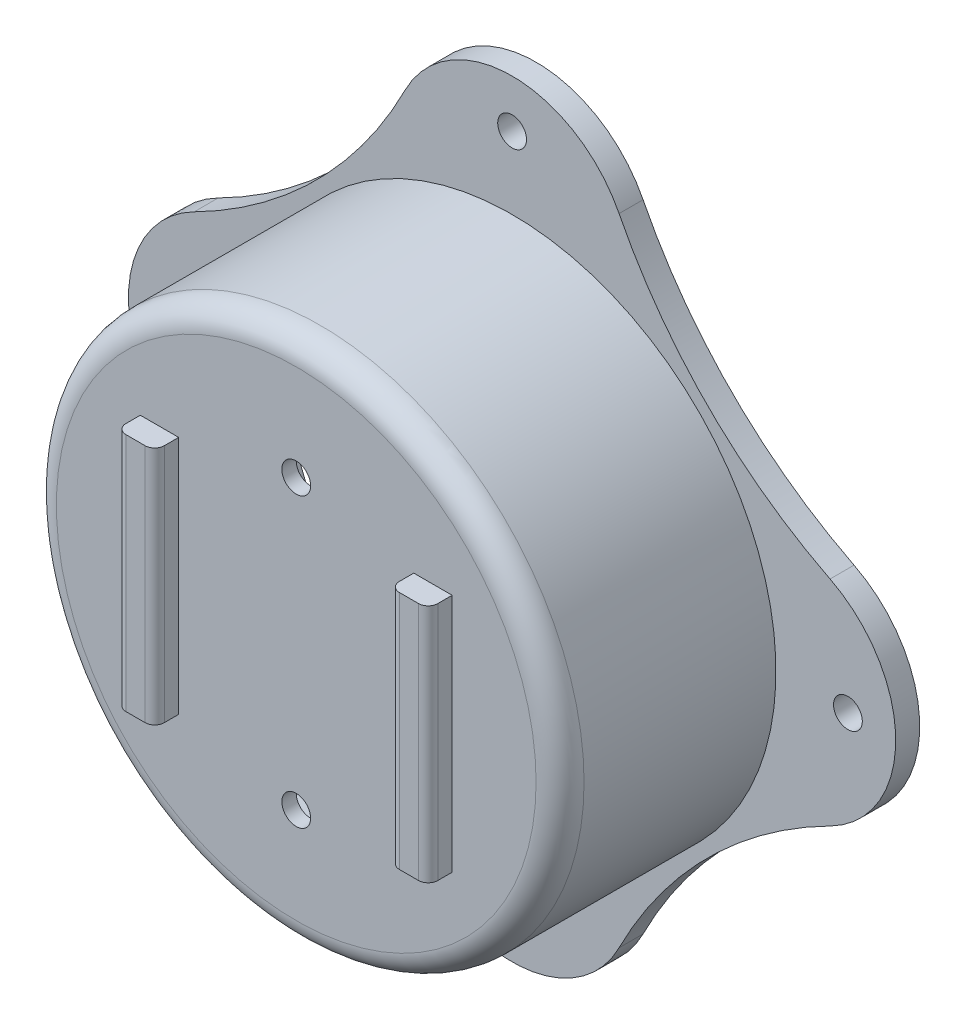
from build123d import *

# Parameters (mm, degrees)
IZIM1_R                     = 55
Y_KSEKLIK_EKSTR_ZYON1_DEPTH = 50
RADYUS1_R                   = 5
Y_KSEKLIK_EKSTR_ZYON2_DEPTH = 5
IZIM3_R                     = 52
KES_EKSTR_ZYON1_DEPTH       = 47
IZIM4_R                     = 3
KES_EKSTR_ZYON2_DEPTH       = 47
IZIM5_W                     = 8
IZIM5_H                     = 50
Y_KSEKLIK_EKSTR_ZYON3_DEPTH = 5
RADYUS2_R                   = 2
IZIM6_R                     = 3
KES_EKSTR_ZYON3_DEPTH       = 5


with BuildPart() as part:
    # izim1 → Y_kseklik-Ekstr_zyon1 (new body)
    with BuildSketch(Plane.XY):
        Circle(IZIM1_R)
    extrude(amount=Y_KSEKLIK_EKSTR_ZYON1_DEPTH)

    # Radyus1
    radyus1_edges = [part.edges().sort_by_distance(p)[0] for p in [
        (-55, 0, 50),
    ]]
    fillet(radyus1_edges, radius=RADYUS1_R)

    # izim2 → Y_kseklik-Ekstr_zyon2 (add)
    with BuildSketch(Plane(origin=(0, 0, 0), x_dir=(-1, 0, 0), z_dir=(0, 0, -1))):
        with BuildLine():
            ThreePointArc((22.297784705, 66.305255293), (-0.001214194, 79.999999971), (-22.298882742, 66.303089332))
            ThreePointArc((-22.298882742, 66.303089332), (-40.780281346, 40.808230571), (-66.273344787, 22.324355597))
            ThreePointArc((-66.273344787, 22.324355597), (-79.968089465, 0.025356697), (-66.271178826, -22.27231185))
            ThreePointArc((-66.271178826, -22.27231185), (-40.776320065, -40.753710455), (-22.292445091, -66.246773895))
            ThreePointArc((-22.292445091, -66.246773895), (0.006553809, -79.941518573), (22.304222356, -66.244607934))
            ThreePointArc((22.304222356, -66.244607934), (40.785620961, -40.749749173), (66.278684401, -22.265874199))
            ThreePointArc((66.278684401, -22.265874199), (79.973429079, 0.0331247), (66.27651844, 22.330793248))
            ThreePointArc((66.27651844, 22.330793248), (40.781659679, 40.812191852), (22.297784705, 66.305255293))
        make_face()
    extrude(amount=-Y_KSEKLIK_EKSTR_ZYON2_DEPTH)

    # izim3 → Kes-Ekstr_zyon1 (cut)
    with BuildSketch(Plane(origin=(0, 0, 0), x_dir=(-1, 0, 0), z_dir=(0, 0, -1))):
        Circle(IZIM3_R)
    extrude(amount=-KES_EKSTR_ZYON1_DEPTH, mode=Mode.SUBTRACT)

    # izim4 → Kes-Ekstr_zyon2 (cut)
    with BuildSketch(Plane.XY.offset(50)):
        with Locations((0, 30)):
            Circle(IZIM4_R)
        with Locations((0, -30)):
            Circle(IZIM4_R)
    extrude(amount=-KES_EKSTR_ZYON2_DEPTH, mode=Mode.SUBTRACT)

    # izim5 → Y_kseklik-Ekstr_zyon3 (add)
    with BuildSketch(Plane.XY.offset(50)):
        with Locations((-28.5, 0)):
            Rectangle(IZIM5_W, IZIM5_H)
        with Locations((28.5, 0)):
            Rectangle(IZIM5_W, IZIM5_H)
    extrude(amount=Y_KSEKLIK_EKSTR_ZYON3_DEPTH)

    # Radyus2
    radyus2_edges = [part.edges().sort_by_distance(p)[0] for p in [
        (-24.5, 0, 55),
        (-32.5, 0, 55),
        (32.5, 0, 55),
        (24.5, 0, 55),
    ]]
    fillet(radyus2_edges, radius=RADYUS2_R)

    # izim6 → Kes-Ekstr_zyon3 (cut)
    with BuildSketch(Plane.XY.offset(5)):
        with Locations((70, 0)):
            Circle(IZIM6_R)
        with Locations((0, -70)):
            Circle(IZIM6_R)
        with Locations((-70, 0)):
            Circle(IZIM6_R)
        with Locations((0, 70)):
            Circle(IZIM6_R)
    extrude(amount=-KES_EKSTR_ZYON3_DEPTH, mode=Mode.SUBTRACT)


solid = part.part
